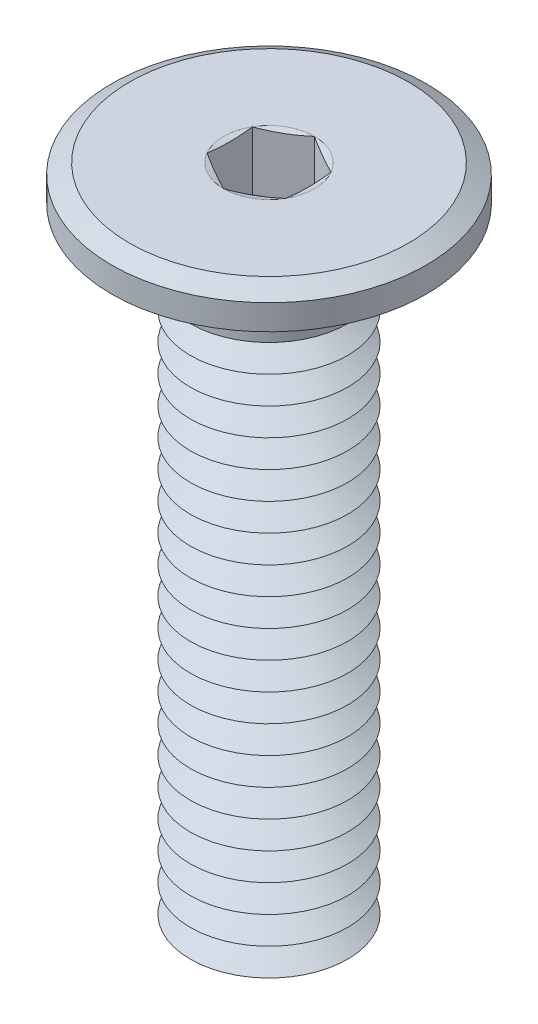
from build123d import *

# Parameters (mm, degrees)
SKETCH1_R           = 4
BOSS_EXTRUDE1_DEPTH = 0.9
SKETCH2_R           = 2
BOSS_EXTRUDE2_DEPTH = 16
LPATTERN1_COUNT     = 21
LPATTERN1_PITCH     = 0.7
FILLET1_R           = 0.2
CHAMFER2_SIZE       = 0.45
CHAMFER2_SIZE2      = 0.259807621
CUT_EXTRUDE1_DEPTH  = 1.5


with BuildPart() as part:
    # Sketch1 → Boss-Extrude1 (new body)
    with BuildSketch(Plane(origin=(0, 0, 0), x_dir=(1, 0, 0), z_dir=(0, 1, 0))):
        with Locations(Location((0, 0, 0), (0, 0, 270))):
            Circle(SKETCH1_R)
    extrude(amount=-BOSS_EXTRUDE1_DEPTH)

    # Sketch2 → Boss-Extrude2 (add)
    with BuildSketch(Plane.XZ.offset(0.9)):
        with Locations(Location((0, 0, 0), (0, 0, 270))):
            Circle(SKETCH2_R)
    extrude(amount=BOSS_EXTRUDE2_DEPTH)

    # Sketch5 → Cut-Revolve1 (revolve, cut)
    with BuildSketch(Plane(origin=(0, 0, 0), x_dir=(0, 0, -1), z_dir=(1, 0, 0))):
        Polygon((-2, -17.25), (-1.393782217, -16.9), (-2, -16.55), align=None)
    cut_revolve1 = revolve(axis=Axis((0, 0.990593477, 0), (0, -1, 0)), mode=Mode.SUBTRACT)

    # LPattern1: Cut-Revolve1 ×21
    with Locations(*[(0, i * LPATTERN1_PITCH, 0) for i in range(1, LPATTERN1_COUNT)]):
        add(cut_revolve1, mode=Mode.SUBTRACT)

    # Fillet1
    fillet1_edges = [part.edges().sort_by_distance(p)[0] for p in [
        (0, -0.9, 2),
    ]]
    fillet(fillet1_edges, radius=FILLET1_R)

    # Chamfer2
    chamfer2_edges = [part.edges().sort_by_distance(p)[0] for p in [
        (0, 0, -4),
    ]]
    chamfer2_side = [part.faces().sort_by_distance(p)[0] for p in [
        (0, 0, 0),
    ]]
    chamfer(chamfer2_edges, length=CHAMFER2_SIZE, length2=CHAMFER2_SIZE2, reference=chamfer2_side[0])

    # Sketch6 → Cut-Extrude1 (cut)
    with BuildSketch(Plane(origin=(0, 0, 0), x_dir=(1, 0, 0), z_dir=(0, 1, 0))):
        Polygon((0, 1.154700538), (-1, 0.577350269), (-1, -0.577350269), (0, -1.154700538), (1, -0.577350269), (1, 0.577350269), align=None)
    extrude(amount=-CUT_EXTRUDE1_DEPTH, mode=Mode.SUBTRACT)

    # Cut-Extrude2 cone 1 section (on through the dimple's axis) → Cut-Extrude2 (revolve, cut)
    with BuildSketch(Plane(origin=(0, -1.5, 0), x_dir=(0, 0, 1), z_dir=(1, 0, 0))):
        Polygon((0, 0), (1, 0), (0, 0.577350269), align=None)
    revolve(axis=Axis((0, -1.5, 0), (0, -1, 0)), mode=Mode.SUBTRACT)

    # Cut-Extrude3 cone 1 section (on through the dimple's axis) → Cut-Extrude3 (revolve, cut)
    with BuildSketch(Plane(origin=(0, 0, 0), x_dir=(0, 0, 1), z_dir=(1, 0, 0))):
        Polygon((0, 0), (1.154700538, 0), (0, 0.309401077), align=None)
    revolve(axis=Axis((0, 0, 0), (0, -1, 0)), mode=Mode.SUBTRACT)


solid = part.part
